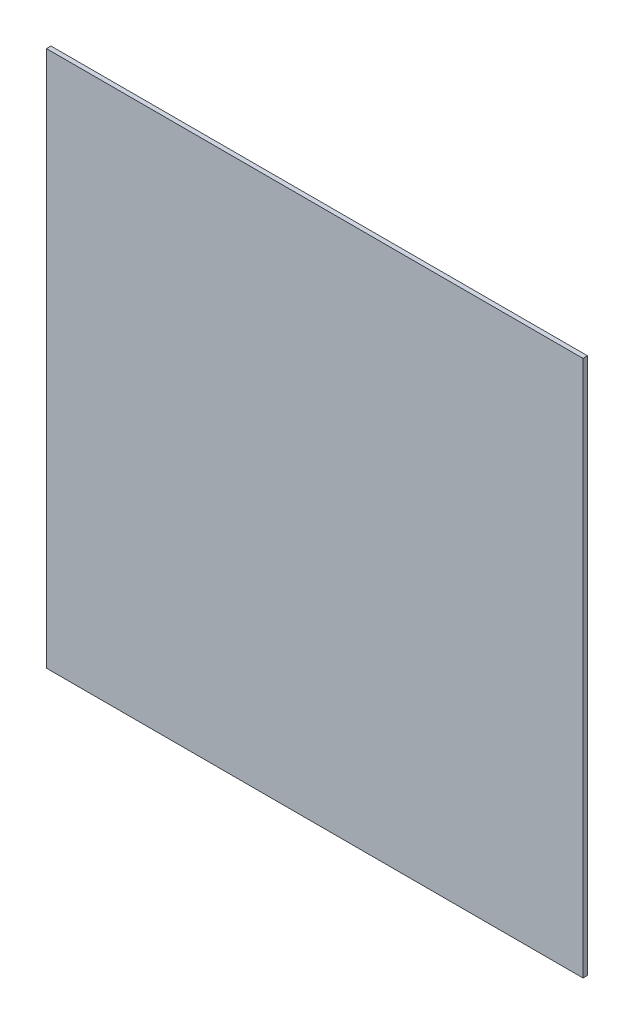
from build123d import *

# Parameters (mm, degrees)
SKETCH1_W           = 595
SKETCH1_H           = 595
BOSS_EXTRUDE1_DEPTH = 5


with BuildPart() as part:
    # Sketch1 → Boss-Extrude1 (new body)
    with BuildSketch(Plane.XY):
        with Locations((-7.5, -7.5)):
            Rectangle(SKETCH1_W, SKETCH1_H)
    extrude(amount=BOSS_EXTRUDE1_DEPTH)


solid = part.part
